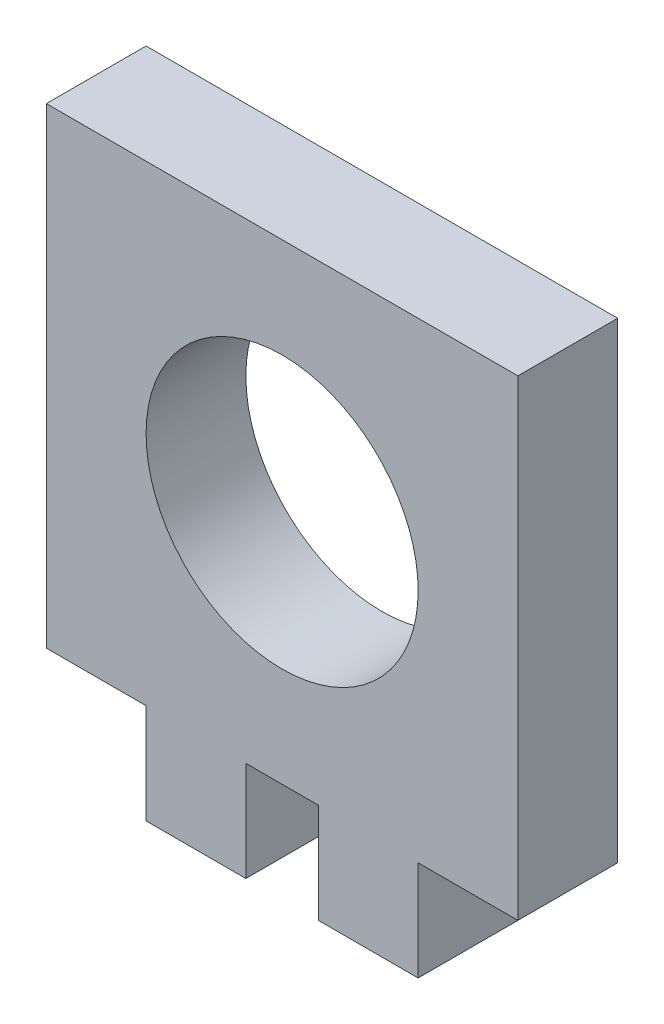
ISO-10303-21;
HEADER;
FILE_DESCRIPTION(('STEP AP214'),'2;1');
FILE_NAME('part.step','',(''),(''),'','','');
FILE_SCHEMA(('AUTOMOTIVE_DESIGN { 1 0 10303 214 1 1 1 1 }'));
ENDSEC;
DATA;
#1=APPLICATION_CONTEXT('core data for automotive mechanical design processes');
#2=APPLICATION_PROTOCOL_DEFINITION('international standard','automotive_design',2000,#1);
#3=PRODUCT_CONTEXT('',#1,'mechanical');
#4=PRODUCT('Part','Part','',(#3));
#5=PRODUCT_RELATED_PRODUCT_CATEGORY('part','',(#4));
#6=PRODUCT_DEFINITION_FORMATION('','',#4);
#7=PRODUCT_DEFINITION_CONTEXT('part definition',#1,'design');
#8=PRODUCT_DEFINITION('design','',#6,#7);
#9=PRODUCT_DEFINITION_SHAPE('','',#8);
#10=(LENGTH_UNIT() NAMED_UNIT(*) SI_UNIT(.MILLI.,.METRE.));
#11=(NAMED_UNIT(*) PLANE_ANGLE_UNIT() SI_UNIT($,.RADIAN.));
#12=(NAMED_UNIT(*) SI_UNIT($,.STERADIAN.) SOLID_ANGLE_UNIT());
#13=UNCERTAINTY_MEASURE_WITH_UNIT(LENGTH_MEASURE(1.E-05),#10,'distance_accuracy_value','');
#14=(GEOMETRIC_REPRESENTATION_CONTEXT(3) GLOBAL_UNCERTAINTY_ASSIGNED_CONTEXT((#13)) GLOBAL_UNIT_ASSIGNED_CONTEXT((#10,
#11,#12)) REPRESENTATION_CONTEXT('',''));
#15=CARTESIAN_POINT('',(0.,0.,0.));
#16=DIRECTION('',(0.,0.,1.));
#17=DIRECTION('',(1.,0.,0.));
#18=AXIS2_PLACEMENT_3D('',#15,#16,#17);
#19=CARTESIAN_POINT('',(0.,0.,5.5));
#20=DIRECTION('',(0.,0.,-1.));
#21=DIRECTION('',(-1.,0.,0.));
#22=AXIS2_PLACEMENT_3D('',#19,#20,#21);
#23=PLANE('',#22);
#24=DIRECTION('',(1.,0.,0.));
#25=VECTOR('',#24,1.);
#26=CARTESIAN_POINT('',(-26.,5.5,5.5));
#27=LINE('',#26,#25);
#28=CARTESIAN_POINT('',(-26.,5.5,5.5));
#29=VERTEX_POINT('',#28);
#30=CARTESIAN_POINT('',(-20.5,5.5,5.5));
#31=VERTEX_POINT('',#30);
#32=EDGE_CURVE('E181',#29,#31,#27,.T.);
#33=ORIENTED_EDGE('',*,*,#32,.T.);
#34=DIRECTION('',(0.,-1.,0.));
#35=VECTOR('',#34,1.);
#36=CARTESIAN_POINT('',(-20.5,5.5,5.5));
#37=LINE('',#36,#35);
#38=CARTESIAN_POINT('',(-20.5,0.,5.5));
#39=VERTEX_POINT('',#38);
#40=EDGE_CURVE('E109',#31,#39,#37,.T.);
#41=ORIENTED_EDGE('',*,*,#40,.T.);
#42=DIRECTION('',(1.,0.,0.));
#43=VECTOR('',#42,1.);
#44=CARTESIAN_POINT('',(-20.5,0.,5.5));
#45=LINE('',#44,#43);
#46=CARTESIAN_POINT('',(-15.,0.,5.5));
#47=VERTEX_POINT('',#46);
#48=EDGE_CURVE('E208',#39,#47,#45,.T.);
#49=ORIENTED_EDGE('',*,*,#48,.T.);
#50=DIRECTION('',(0.,1.,0.));
#51=VECTOR('',#50,1.);
#52=CARTESIAN_POINT('',(-15.,0.,5.5));
#53=LINE('',#52,#51);
#54=CARTESIAN_POINT('',(-15.,5.5,5.5));
#55=VERTEX_POINT('',#54);
#56=EDGE_CURVE('E227',#47,#55,#53,.T.);
#57=ORIENTED_EDGE('',*,*,#56,.T.);
#58=DIRECTION('',(1.,0.,0.));
#59=VECTOR('',#58,1.);
#60=CARTESIAN_POINT('',(-15.,5.5,5.5));
#61=LINE('',#60,#59);
#62=CARTESIAN_POINT('',(-11.,5.5,5.5));
#63=VERTEX_POINT('',#62);
#64=EDGE_CURVE('E224',#55,#63,#61,.T.);
#65=ORIENTED_EDGE('',*,*,#64,.T.);
#66=DIRECTION('',(0.,-1.,0.));
#67=VECTOR('',#66,1.);
#68=CARTESIAN_POINT('',(-11.,5.5,5.5));
#69=LINE('',#68,#67);
#70=CARTESIAN_POINT('',(-11.,0.,5.5));
#71=VERTEX_POINT('',#70);
#72=EDGE_CURVE('E226',#63,#71,#69,.T.);
#73=ORIENTED_EDGE('',*,*,#72,.T.);
#74=DIRECTION('',(1.,0.,0.));
#75=VECTOR('',#74,1.);
#76=CARTESIAN_POINT('',(-11.,0.,5.5));
#77=LINE('',#76,#75);
#78=CARTESIAN_POINT('',(-5.5,0.,5.5));
#79=VERTEX_POINT('',#78);
#80=EDGE_CURVE('E229',#71,#79,#77,.T.);
#81=ORIENTED_EDGE('',*,*,#80,.T.);
#82=DIRECTION('',(0.,1.,0.));
#83=VECTOR('',#82,1.);
#84=CARTESIAN_POINT('',(-5.5,0.,5.5));
#85=LINE('',#84,#83);
#86=CARTESIAN_POINT('',(-5.5,5.5,5.5));
#87=VERTEX_POINT('',#86);
#88=EDGE_CURVE('E235',#79,#87,#85,.T.);
#89=ORIENTED_EDGE('',*,*,#88,.T.);
#90=DIRECTION('',(1.,0.,0.));
#91=VECTOR('',#90,1.);
#92=CARTESIAN_POINT('',(-5.5,5.5,5.5));
#93=LINE('',#92,#91);
#94=CARTESIAN_POINT('',(0.,5.5,5.5));
#95=VERTEX_POINT('',#94);
#96=EDGE_CURVE('E140',#87,#95,#93,.T.);
#97=ORIENTED_EDGE('',*,*,#96,.T.);
#98=DIRECTION('',(0.,1.,0.));
#99=VECTOR('',#98,1.);
#100=CARTESIAN_POINT('',(0.,5.5,5.5));
#101=LINE('',#100,#99);
#102=CARTESIAN_POINT('',(0.,31.5,5.5));
#103=VERTEX_POINT('',#102);
#104=EDGE_CURVE('E134',#95,#103,#101,.T.);
#105=ORIENTED_EDGE('',*,*,#104,.T.);
#106=DIRECTION('',(-1.,0.,0.));
#107=VECTOR('',#106,1.);
#108=CARTESIAN_POINT('',(0.,31.5,5.5));
#109=LINE('',#108,#107);
#110=CARTESIAN_POINT('',(-26.,31.5,5.5));
#111=VERTEX_POINT('',#110);
#112=EDGE_CURVE('E138',#103,#111,#109,.T.);
#113=ORIENTED_EDGE('',*,*,#112,.T.);
#114=DIRECTION('',(0.,-1.,0.));
#115=VECTOR('',#114,1.);
#116=CARTESIAN_POINT('',(-26.,31.5,5.5));
#117=LINE('',#116,#115);
#118=EDGE_CURVE('E54',#111,#29,#117,.T.);
#119=ORIENTED_EDGE('',*,*,#118,.T.);
#120=EDGE_LOOP('',(#33,#41,#49,#57,#65,#73,#81,#89,#97,#105,#113,#119));
#121=FACE_BOUND('',#120,.T.);
#122=CARTESIAN_POINT('',(-13.,18.5,5.5));
#123=DIRECTION('',(0.,0.,1.));
#124=DIRECTION('',(1.,0.,0.));
#125=AXIS2_PLACEMENT_3D('',#122,#123,#124);
#126=CIRCLE('',#125,7.5);
#127=CARTESIAN_POINT('',(-5.5,18.5,5.5));
#128=VERTEX_POINT('',#127);
#129=EDGE_CURVE('E162',#128,#128,#126,.T.);
#130=ORIENTED_EDGE('',*,*,#129,.F.);
#131=EDGE_LOOP('',(#130));
#132=FACE_BOUND('',#131,.T.);
#133=ADVANCED_FACE('F37',(#121,#132),#23,.F.);
#134=CARTESIAN_POINT('',(0.,0.,0.));
#135=DIRECTION('',(0.,0.,-1.));
#136=DIRECTION('',(-1.,0.,0.));
#137=AXIS2_PLACEMENT_3D('',#134,#135,#136);
#138=PLANE('',#137);
#139=DIRECTION('',(1.,0.,0.));
#140=VECTOR('',#139,1.);
#141=CARTESIAN_POINT('',(-26.,5.5,0.));
#142=LINE('',#141,#140);
#143=CARTESIAN_POINT('',(-26.,5.5,0.));
#144=VERTEX_POINT('',#143);
#145=CARTESIAN_POINT('',(-20.5,5.5,0.));
#146=VERTEX_POINT('',#145);
#147=EDGE_CURVE('E158',#144,#146,#142,.T.);
#148=ORIENTED_EDGE('',*,*,#147,.F.);
#149=DIRECTION('',(0.,-1.,0.));
#150=VECTOR('',#149,1.);
#151=CARTESIAN_POINT('',(-26.,31.5,0.));
#152=LINE('',#151,#150);
#153=CARTESIAN_POINT('',(-26.,31.5,0.));
#154=VERTEX_POINT('',#153);
#155=EDGE_CURVE('E101',#154,#144,#152,.T.);
#156=ORIENTED_EDGE('',*,*,#155,.F.);
#157=DIRECTION('',(-1.,0.,0.));
#158=VECTOR('',#157,1.);
#159=CARTESIAN_POINT('',(0.,31.5,0.));
#160=LINE('',#159,#158);
#161=CARTESIAN_POINT('',(0.,31.5,0.));
#162=VERTEX_POINT('',#161);
#163=EDGE_CURVE('E95',#162,#154,#160,.T.);
#164=ORIENTED_EDGE('',*,*,#163,.F.);
#165=DIRECTION('',(0.,1.,0.));
#166=VECTOR('',#165,1.);
#167=CARTESIAN_POINT('',(0.,5.5,0.));
#168=LINE('',#167,#166);
#169=CARTESIAN_POINT('',(0.,5.5,0.));
#170=VERTEX_POINT('',#169);
#171=EDGE_CURVE('E148',#170,#162,#168,.T.);
#172=ORIENTED_EDGE('',*,*,#171,.F.);
#173=DIRECTION('',(1.,0.,0.));
#174=VECTOR('',#173,1.);
#175=CARTESIAN_POINT('',(-5.5,5.5,0.));
#176=LINE('',#175,#174);
#177=CARTESIAN_POINT('',(-5.5,5.5,0.));
#178=VERTEX_POINT('',#177);
#179=EDGE_CURVE('E176',#178,#170,#176,.T.);
#180=ORIENTED_EDGE('',*,*,#179,.F.);
#181=DIRECTION('',(0.,1.,0.));
#182=VECTOR('',#181,1.);
#183=CARTESIAN_POINT('',(-5.5,0.,0.));
#184=LINE('',#183,#182);
#185=CARTESIAN_POINT('',(-5.5,0.,0.));
#186=VERTEX_POINT('',#185);
#187=EDGE_CURVE('E174',#186,#178,#184,.T.);
#188=ORIENTED_EDGE('',*,*,#187,.F.);
#189=DIRECTION('',(1.,0.,0.));
#190=VECTOR('',#189,1.);
#191=CARTESIAN_POINT('',(-11.,0.,0.));
#192=LINE('',#191,#190);
#193=CARTESIAN_POINT('',(-11.,0.,0.));
#194=VERTEX_POINT('',#193);
#195=EDGE_CURVE('E172',#194,#186,#192,.T.);
#196=ORIENTED_EDGE('',*,*,#195,.F.);
#197=DIRECTION('',(0.,-1.,0.));
#198=VECTOR('',#197,1.);
#199=CARTESIAN_POINT('',(-11.,5.5,0.));
#200=LINE('',#199,#198);
#201=CARTESIAN_POINT('',(-11.,5.5,0.));
#202=VERTEX_POINT('',#201);
#203=EDGE_CURVE('E170',#202,#194,#200,.T.);
#204=ORIENTED_EDGE('',*,*,#203,.F.);
#205=DIRECTION('',(1.,0.,0.));
#206=VECTOR('',#205,1.);
#207=CARTESIAN_POINT('',(-15.,5.5,0.));
#208=LINE('',#207,#206);
#209=CARTESIAN_POINT('',(-15.,5.5,0.));
#210=VERTEX_POINT('',#209);
#211=EDGE_CURVE('E168',#210,#202,#208,.T.);
#212=ORIENTED_EDGE('',*,*,#211,.F.);
#213=DIRECTION('',(0.,1.,0.));
#214=VECTOR('',#213,1.);
#215=CARTESIAN_POINT('',(-15.,0.,0.));
#216=LINE('',#215,#214);
#217=CARTESIAN_POINT('',(-15.,0.,0.));
#218=VERTEX_POINT('',#217);
#219=EDGE_CURVE('E166',#218,#210,#216,.T.);
#220=ORIENTED_EDGE('',*,*,#219,.F.);
#221=DIRECTION('',(1.,0.,0.));
#222=VECTOR('',#221,1.);
#223=CARTESIAN_POINT('',(-20.5,0.,0.));
#224=LINE('',#223,#222);
#225=CARTESIAN_POINT('',(-20.5,0.,0.));
#226=VERTEX_POINT('',#225);
#227=EDGE_CURVE('E164',#226,#218,#224,.T.);
#228=ORIENTED_EDGE('',*,*,#227,.F.);
#229=DIRECTION('',(0.,-1.,0.));
#230=VECTOR('',#229,1.);
#231=CARTESIAN_POINT('',(-20.5,5.5,0.));
#232=LINE('',#231,#230);
#233=EDGE_CURVE('E161',#146,#226,#232,.T.);
#234=ORIENTED_EDGE('',*,*,#233,.F.);
#235=EDGE_LOOP('',(#148,#156,#164,#172,#180,#188,#196,#204,#212,#220,#228,#234));
#236=FACE_BOUND('',#235,.T.);
#237=CARTESIAN_POINT('',(-13.,18.5,0.));
#238=DIRECTION('',(0.,0.,1.));
#239=DIRECTION('',(1.,0.,0.));
#240=AXIS2_PLACEMENT_3D('',#237,#238,#239);
#241=CIRCLE('',#240,7.5);
#242=CARTESIAN_POINT('',(-5.5,18.5,0.));
#243=VERTEX_POINT('',#242);
#244=EDGE_CURVE('E382',#243,#243,#241,.T.);
#245=ORIENTED_EDGE('',*,*,#244,.T.);
#246=EDGE_LOOP('',(#245));
#247=FACE_BOUND('',#246,.T.);
#248=ADVANCED_FACE('F212',(#236,#247),#138,.T.);
#249=CARTESIAN_POINT('',(-26.,5.5,5.5));
#250=DIRECTION('',(0.,1.,0.));
#251=DIRECTION('',(0.,0.,1.));
#252=AXIS2_PLACEMENT_3D('',#249,#250,#251);
#253=PLANE('',#252);
#254=ORIENTED_EDGE('',*,*,#147,.T.);
#255=DIRECTION('',(0.,0.,-1.));
#256=VECTOR('',#255,1.);
#257=CARTESIAN_POINT('',(-20.5,5.5,5.5));
#258=LINE('',#257,#256);
#259=EDGE_CURVE('E11',#31,#146,#258,.T.);
#260=ORIENTED_EDGE('',*,*,#259,.F.);
#261=ORIENTED_EDGE('',*,*,#32,.F.);
#262=DIRECTION('',(0.,0.,-1.));
#263=VECTOR('',#262,1.);
#264=CARTESIAN_POINT('',(-26.,5.5,5.5));
#265=LINE('',#264,#263);
#266=EDGE_CURVE('E154',#29,#144,#265,.T.);
#267=ORIENTED_EDGE('',*,*,#266,.T.);
#268=EDGE_LOOP('',(#254,#260,#261,#267));
#269=FACE_BOUND('',#268,.T.);
#270=ADVANCED_FACE('F39',(#269),#253,.F.);
#271=CARTESIAN_POINT('',(-20.5,5.5,5.5));
#272=DIRECTION('',(1.,0.,0.));
#273=DIRECTION('',(0.,0.,-1.));
#274=AXIS2_PLACEMENT_3D('',#271,#272,#273);
#275=PLANE('',#274);
#276=ORIENTED_EDGE('',*,*,#233,.T.);
#277=DIRECTION('',(0.,0.,-1.));
#278=VECTOR('',#277,1.);
#279=CARTESIAN_POINT('',(-20.5,0.,5.5));
#280=LINE('',#279,#278);
#281=EDGE_CURVE('E46',#39,#226,#280,.T.);
#282=ORIENTED_EDGE('',*,*,#281,.F.);
#283=ORIENTED_EDGE('',*,*,#40,.F.);
#284=ORIENTED_EDGE('',*,*,#259,.T.);
#285=EDGE_LOOP('',(#276,#282,#283,#284));
#286=FACE_BOUND('',#285,.T.);
#287=ADVANCED_FACE('F269',(#286),#275,.F.);
#288=CARTESIAN_POINT('',(-20.5,0.,5.5));
#289=DIRECTION('',(0.,1.,0.));
#290=DIRECTION('',(0.,0.,1.));
#291=AXIS2_PLACEMENT_3D('',#288,#289,#290);
#292=PLANE('',#291);
#293=ORIENTED_EDGE('',*,*,#227,.T.);
#294=DIRECTION('',(0.,0.,-1.));
#295=VECTOR('',#294,1.);
#296=CARTESIAN_POINT('',(-15.,0.,5.5));
#297=LINE('',#296,#295);
#298=EDGE_CURVE('E200',#47,#218,#297,.T.);
#299=ORIENTED_EDGE('',*,*,#298,.F.);
#300=ORIENTED_EDGE('',*,*,#48,.F.);
#301=ORIENTED_EDGE('',*,*,#281,.T.);
#302=EDGE_LOOP('',(#293,#299,#300,#301));
#303=FACE_BOUND('',#302,.T.);
#304=ADVANCED_FACE('F206',(#303),#292,.F.);
#305=CARTESIAN_POINT('',(-15.,0.,5.5));
#306=DIRECTION('',(-1.,0.,0.));
#307=DIRECTION('',(0.,0.,1.));
#308=AXIS2_PLACEMENT_3D('',#305,#306,#307);
#309=PLANE('',#308);
#310=ORIENTED_EDGE('',*,*,#219,.T.);
#311=DIRECTION('',(0.,0.,-1.));
#312=VECTOR('',#311,1.);
#313=CARTESIAN_POINT('',(-15.,5.5,5.5));
#314=LINE('',#313,#312);
#315=EDGE_CURVE('E197',#55,#210,#314,.T.);
#316=ORIENTED_EDGE('',*,*,#315,.F.);
#317=ORIENTED_EDGE('',*,*,#56,.F.);
#318=ORIENTED_EDGE('',*,*,#298,.T.);
#319=EDGE_LOOP('',(#310,#316,#317,#318));
#320=FACE_BOUND('',#319,.T.);
#321=ADVANCED_FACE('F218',(#320),#309,.F.);
#322=CARTESIAN_POINT('',(-15.,5.5,5.5));
#323=DIRECTION('',(0.,1.,0.));
#324=DIRECTION('',(0.,0.,1.));
#325=AXIS2_PLACEMENT_3D('',#322,#323,#324);
#326=PLANE('',#325);
#327=ORIENTED_EDGE('',*,*,#211,.T.);
#328=DIRECTION('',(0.,0.,-1.));
#329=VECTOR('',#328,1.);
#330=CARTESIAN_POINT('',(-11.,5.5,5.5));
#331=LINE('',#330,#329);
#332=EDGE_CURVE('E194',#63,#202,#331,.T.);
#333=ORIENTED_EDGE('',*,*,#332,.F.);
#334=ORIENTED_EDGE('',*,*,#64,.F.);
#335=ORIENTED_EDGE('',*,*,#315,.T.);
#336=EDGE_LOOP('',(#327,#333,#334,#335));
#337=FACE_BOUND('',#336,.T.);
#338=ADVANCED_FACE('F222',(#337),#326,.F.);
#339=CARTESIAN_POINT('',(-11.,5.5,5.5));
#340=DIRECTION('',(1.,0.,0.));
#341=DIRECTION('',(0.,0.,-1.));
#342=AXIS2_PLACEMENT_3D('',#339,#340,#341);
#343=PLANE('',#342);
#344=ORIENTED_EDGE('',*,*,#203,.T.);
#345=DIRECTION('',(0.,0.,-1.));
#346=VECTOR('',#345,1.);
#347=CARTESIAN_POINT('',(-11.,0.,5.5));
#348=LINE('',#347,#346);
#349=EDGE_CURVE('E191',#71,#194,#348,.T.);
#350=ORIENTED_EDGE('',*,*,#349,.F.);
#351=ORIENTED_EDGE('',*,*,#72,.F.);
#352=ORIENTED_EDGE('',*,*,#332,.T.);
#353=EDGE_LOOP('',(#344,#350,#351,#352));
#354=FACE_BOUND('',#353,.T.);
#355=ADVANCED_FACE('F282',(#354),#343,.F.);
#356=CARTESIAN_POINT('',(-11.,0.,5.5));
#357=DIRECTION('',(0.,1.,0.));
#358=DIRECTION('',(0.,0.,1.));
#359=AXIS2_PLACEMENT_3D('',#356,#357,#358);
#360=PLANE('',#359);
#361=ORIENTED_EDGE('',*,*,#195,.T.);
#362=DIRECTION('',(0.,0.,-1.));
#363=VECTOR('',#362,1.);
#364=CARTESIAN_POINT('',(-5.5,0.,5.5));
#365=LINE('',#364,#363);
#366=EDGE_CURVE('E188',#79,#186,#365,.T.);
#367=ORIENTED_EDGE('',*,*,#366,.F.);
#368=ORIENTED_EDGE('',*,*,#80,.F.);
#369=ORIENTED_EDGE('',*,*,#349,.T.);
#370=EDGE_LOOP('',(#361,#367,#368,#369));
#371=FACE_BOUND('',#370,.T.);
#372=ADVANCED_FACE('F285',(#371),#360,.F.);
#373=CARTESIAN_POINT('',(-5.5,0.,5.5));
#374=DIRECTION('',(-1.,0.,0.));
#375=DIRECTION('',(0.,0.,1.));
#376=AXIS2_PLACEMENT_3D('',#373,#374,#375);
#377=PLANE('',#376);
#378=ORIENTED_EDGE('',*,*,#187,.T.);
#379=DIRECTION('',(0.,0.,-1.));
#380=VECTOR('',#379,1.);
#381=CARTESIAN_POINT('',(-5.5,5.5,5.5));
#382=LINE('',#381,#380);
#383=EDGE_CURVE('E185',#87,#178,#382,.T.);
#384=ORIENTED_EDGE('',*,*,#383,.F.);
#385=ORIENTED_EDGE('',*,*,#88,.F.);
#386=ORIENTED_EDGE('',*,*,#366,.T.);
#387=EDGE_LOOP('',(#378,#384,#385,#386));
#388=FACE_BOUND('',#387,.T.);
#389=ADVANCED_FACE('F241',(#388),#377,.F.);
#390=CARTESIAN_POINT('',(-5.5,5.5,5.5));
#391=DIRECTION('',(0.,1.,0.));
#392=DIRECTION('',(0.,0.,1.));
#393=AXIS2_PLACEMENT_3D('',#390,#391,#392);
#394=PLANE('',#393);
#395=ORIENTED_EDGE('',*,*,#179,.T.);
#396=DIRECTION('',(0.,0.,-1.));
#397=VECTOR('',#396,1.);
#398=CARTESIAN_POINT('',(0.,5.5,5.5));
#399=LINE('',#398,#397);
#400=EDGE_CURVE('E149',#95,#170,#399,.T.);
#401=ORIENTED_EDGE('',*,*,#400,.F.);
#402=ORIENTED_EDGE('',*,*,#96,.F.);
#403=ORIENTED_EDGE('',*,*,#383,.T.);
#404=EDGE_LOOP('',(#395,#401,#402,#403));
#405=FACE_BOUND('',#404,.T.);
#406=ADVANCED_FACE('F245',(#405),#394,.F.);
#407=CARTESIAN_POINT('',(0.,5.5,5.5));
#408=DIRECTION('',(-1.,0.,0.));
#409=DIRECTION('',(0.,0.,1.));
#410=AXIS2_PLACEMENT_3D('',#407,#408,#409);
#411=PLANE('',#410);
#412=ORIENTED_EDGE('',*,*,#171,.T.);
#413=DIRECTION('',(0.,0.,-1.));
#414=VECTOR('',#413,1.);
#415=CARTESIAN_POINT('',(0.,31.5,5.5));
#416=LINE('',#415,#414);
#417=EDGE_CURVE('E145',#103,#162,#416,.T.);
#418=ORIENTED_EDGE('',*,*,#417,.F.);
#419=ORIENTED_EDGE('',*,*,#104,.F.);
#420=ORIENTED_EDGE('',*,*,#400,.T.);
#421=EDGE_LOOP('',(#412,#418,#419,#420));
#422=FACE_BOUND('',#421,.T.);
#423=ADVANCED_FACE('F146',(#422),#411,.F.);
#424=CARTESIAN_POINT('',(0.,31.5,5.5));
#425=DIRECTION('',(0.,-1.,0.));
#426=DIRECTION('',(0.,0.,-1.));
#427=AXIS2_PLACEMENT_3D('',#424,#425,#426);
#428=PLANE('',#427);
#429=ORIENTED_EDGE('',*,*,#163,.T.);
#430=DIRECTION('',(0.,0.,-1.));
#431=VECTOR('',#430,1.);
#432=CARTESIAN_POINT('',(-26.,31.5,5.5));
#433=LINE('',#432,#431);
#434=EDGE_CURVE('E150',#111,#154,#433,.T.);
#435=ORIENTED_EDGE('',*,*,#434,.F.);
#436=ORIENTED_EDGE('',*,*,#112,.F.);
#437=ORIENTED_EDGE('',*,*,#417,.T.);
#438=EDGE_LOOP('',(#429,#435,#436,#437));
#439=FACE_BOUND('',#438,.T.);
#440=ADVANCED_FACE('F152',(#439),#428,.F.);
#441=CARTESIAN_POINT('',(-26.,31.5,5.5));
#442=DIRECTION('',(1.,0.,0.));
#443=DIRECTION('',(0.,0.,-1.));
#444=AXIS2_PLACEMENT_3D('',#441,#442,#443);
#445=PLANE('',#444);
#446=ORIENTED_EDGE('',*,*,#155,.T.);
#447=ORIENTED_EDGE('',*,*,#266,.F.);
#448=ORIENTED_EDGE('',*,*,#118,.F.);
#449=ORIENTED_EDGE('',*,*,#434,.T.);
#450=EDGE_LOOP('',(#446,#447,#448,#449));
#451=FACE_BOUND('',#450,.T.);
#452=ADVANCED_FACE('F249',(#451),#445,.F.);
#453=CARTESIAN_POINT('',(-13.,18.5,5.5));
#454=DIRECTION('',(0.,0.,-1.));
#455=DIRECTION('',(-1.,0.,0.));
#456=AXIS2_PLACEMENT_3D('',#453,#454,#455);
#457=CYLINDRICAL_SURFACE('',#456,7.5);
#458=ORIENTED_EDGE('',*,*,#129,.T.);
#459=EDGE_LOOP('',(#458));
#460=FACE_BOUND('',#459,.T.);
#461=ORIENTED_EDGE('',*,*,#244,.F.);
#462=EDGE_LOOP('',(#461));
#463=FACE_BOUND('',#462,.T.);
#464=ADVANCED_FACE('F251',(#460,#463),#457,.F.);
#465=CLOSED_SHELL('',(#133,#248,#270,#287,#304,#321,#338,#355,#372,#389,#406,#423,#440,#452,#464));
#466=MANIFOLD_SOLID_BREP('B2',#465);
#467=ADVANCED_BREP_SHAPE_REPRESENTATION('',(#18,#466),#14);
#468=SHAPE_DEFINITION_REPRESENTATION(#9,#467);
ENDSEC;
END-ISO-10303-21;
